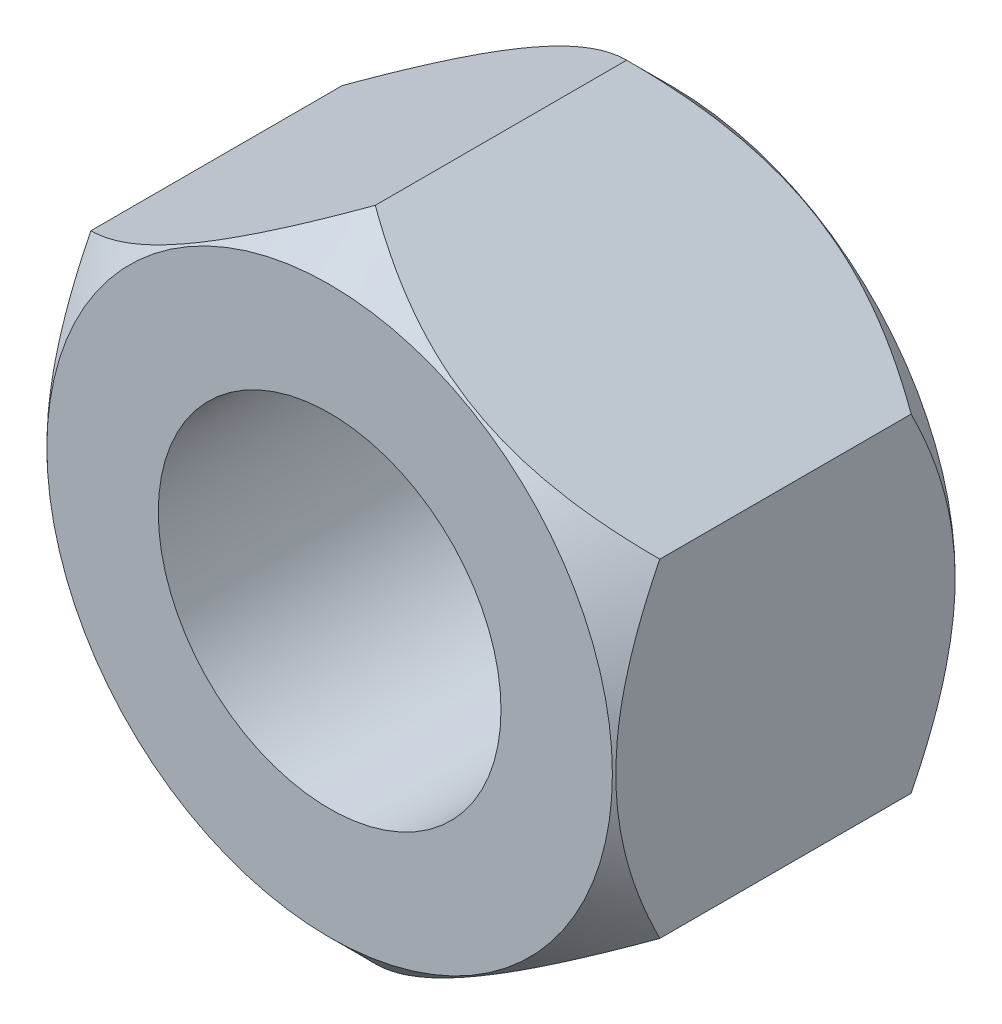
ISO-10303-21;
HEADER;
FILE_DESCRIPTION(('STEP AP214'),'2;1');
FILE_NAME('part.step','',(''),(''),'','','');
FILE_SCHEMA(('AUTOMOTIVE_DESIGN { 1 0 10303 214 1 1 1 1 }'));
ENDSEC;
DATA;
#1=APPLICATION_CONTEXT('core data for automotive mechanical design processes');
#2=APPLICATION_PROTOCOL_DEFINITION('international standard','automotive_design',2000,#1);
#3=PRODUCT_CONTEXT('',#1,'mechanical');
#4=PRODUCT('Part','Part','',(#3));
#5=PRODUCT_RELATED_PRODUCT_CATEGORY('part','',(#4));
#6=PRODUCT_DEFINITION_FORMATION('','',#4);
#7=PRODUCT_DEFINITION_CONTEXT('part definition',#1,'design');
#8=PRODUCT_DEFINITION('design','',#6,#7);
#9=PRODUCT_DEFINITION_SHAPE('','',#8);
#10=(LENGTH_UNIT() NAMED_UNIT(*) SI_UNIT(.MILLI.,.METRE.));
#11=(NAMED_UNIT(*) PLANE_ANGLE_UNIT() SI_UNIT($,.RADIAN.));
#12=(NAMED_UNIT(*) SI_UNIT($,.STERADIAN.) SOLID_ANGLE_UNIT());
#13=UNCERTAINTY_MEASURE_WITH_UNIT(LENGTH_MEASURE(1.E-05),#10,'distance_accuracy_value','');
#14=(GEOMETRIC_REPRESENTATION_CONTEXT(3) GLOBAL_UNCERTAINTY_ASSIGNED_CONTEXT((#13)) GLOBAL_UNIT_ASSIGNED_CONTEXT((#10,
#11,#12)) REPRESENTATION_CONTEXT('',''));
#15=CARTESIAN_POINT('',(0.,0.,0.));
#16=DIRECTION('',(0.,0.,1.));
#17=DIRECTION('',(1.,0.,0.));
#18=AXIS2_PLACEMENT_3D('',#15,#16,#17);
#19=CARTESIAN_POINT('',(0.,0.,6.));
#20=DIRECTION('',(0.,0.,-1.));
#21=DIRECTION('',(-1.,0.,0.));
#22=AXIS2_PLACEMENT_3D('',#19,#20,#21);
#23=CONICAL_SURFACE('',#22,4.95,0.785398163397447);
#24=CARTESIAN_POINT('',(0.,0.,6.));
#25=DIRECTION('',(0.,0.,1.));
#26=DIRECTION('',(1.,0.,0.));
#27=AXIS2_PLACEMENT_3D('',#24,#25,#26);
#28=CIRCLE('',#27,4.95);
#29=CARTESIAN_POINT('',(4.95,0.,6.));
#30=VERTEX_POINT('',#29);
#31=EDGE_CURVE('E235',#30,#30,#28,.T.);
#32=ORIENTED_EDGE('',*,*,#31,.F.);
#33=EDGE_LOOP('',(#32));
#34=FACE_BOUND('',#33,.T.);
#35=CARTESIAN_POINT('',(-0.000200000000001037,-5.75011547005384,5.19988452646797));
#36=CARTESIAN_POINT('',(0.0854228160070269,-5.70068111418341,5.24931443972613));
#37=CARTESIAN_POINT('',(0.171703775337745,-5.65086677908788,5.29722744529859));
#38=CARTESIAN_POINT('',(0.345711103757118,-5.55040360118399,5.38955819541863));
#39=CARTESIAN_POINT('',(0.433438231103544,-5.49975432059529,5.43397403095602));
#40=CARTESIAN_POINT('',(0.699797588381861,-5.34597167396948,5.56166239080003));
#41=CARTESIAN_POINT('',(0.880684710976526,-5.24153644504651,5.63883102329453));
#42=CARTESIAN_POINT('',(1.24545808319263,-5.03093444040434,5.77097708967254));
#43=CARTESIAN_POINT('',(1.42925109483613,-4.92482149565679,5.82628745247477));
#44=CARTESIAN_POINT('',(1.70796230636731,-4.7639075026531,5.89026802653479));
#45=CARTESIAN_POINT('',(1.80127638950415,-4.71003259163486,5.90842216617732));
#46=CARTESIAN_POINT('',(1.98869467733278,-4.60182659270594,5.93799130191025));
#47=CARTESIAN_POINT('',(2.08279876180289,-4.54749557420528,5.94940730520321));
#48=CARTESIAN_POINT('',(2.31211551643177,-4.41509948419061,5.96854775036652));
#49=CARTESIAN_POINT('',(2.44757526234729,-4.33689176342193,5.97256391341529));
#50=CARTESIAN_POINT('',(2.71825062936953,-4.18061726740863,5.96582390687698));
#51=CARTESIAN_POINT('',(2.85346614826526,-4.10255055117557,5.95506255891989));
#52=CARTESIAN_POINT('',(3.12262241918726,-3.94715310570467,5.9194018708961));
#53=CARTESIAN_POINT('',(3.25656157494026,-3.86982329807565,5.89448671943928));
#54=CARTESIAN_POINT('',(3.52213780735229,-3.7164927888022,5.83187297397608));
#55=CARTESIAN_POINT('',(3.65377505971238,-3.64049198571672,5.79417536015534));
#56=CARTESIAN_POINT('',(3.88745848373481,-3.50557479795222,5.71661848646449));
#57=CARTESIAN_POINT('',(3.99002202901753,-3.44635970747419,5.67879867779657));
#58=CARTESIAN_POINT('',(4.19330791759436,-3.32899254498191,5.59706431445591));
#59=CARTESIAN_POINT('',(4.29403020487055,-3.2708405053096,5.5531495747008));
#60=CARTESIAN_POINT('',(4.49331634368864,-3.15578259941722,5.46020981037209));
#61=CARTESIAN_POINT('',(4.59188586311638,-3.09887346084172,5.41120085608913));
#62=CARTESIAN_POINT('',(4.78719959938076,-2.98610902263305,5.308716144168));
#63=CARTESIAN_POINT('',(4.88394489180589,-2.93025310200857,5.25524312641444));
#64=CARTESIAN_POINT('',(4.97984607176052,-2.87488452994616,5.19988452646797));
#65=B_SPLINE_CURVE_WITH_KNOTS('',3,(#35,#36,#37,#38,#39,#40,#41,#42,#43,#44,#45,#46,#47,#48,#49,
#50,#51,#52,#53,#54,#55,#56,#57,#58,#59,#60,#61,#62,#63,#64),.UNSPECIFIED.,.F.,.F.,(4,2,2,2,2,2,
2,2,2,2,2,2,2,2,4),(0.,0.331590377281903,0.663360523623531,1.33048285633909,1.98701153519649,
2.31463197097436,2.64220342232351,3.11087506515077,3.57971098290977,4.04907167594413,
4.51839638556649,4.89118842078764,5.26399177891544,5.63565286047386,6.0070874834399),.UNSPECIFIED.);
#66=CARTESIAN_POINT('',(0.,-5.75,5.2));
#67=VERTEX_POINT('',#66);
#68=CARTESIAN_POINT('',(4.97964607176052,-2.875,5.2));
#69=VERTEX_POINT('',#68);
#70=EDGE_CURVE('E176',#67,#69,#65,.T.);
#71=ORIENTED_EDGE('',*,*,#70,.T.);
#72=CARTESIAN_POINT('',(4.97964607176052,-5.98792729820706,3.16205108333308));
#73=CARTESIAN_POINT('',(4.97964607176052,-5.84321555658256,3.27329073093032));
#74=CARTESIAN_POINT('',(4.97964607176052,-5.69772272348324,3.38353024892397));
#75=CARTESIAN_POINT('',(4.97964607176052,-5.40485610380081,3.60155250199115));
#76=CARTESIAN_POINT('',(4.97964607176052,-5.2574818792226,3.70933464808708));
#77=CARTESIAN_POINT('',(4.97964607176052,-4.95945660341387,3.92275269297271));
#78=CARTESIAN_POINT('',(4.97964607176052,-4.80878904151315,4.02836561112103));
#79=CARTESIAN_POINT('',(4.97964607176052,-4.50494403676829,4.23590471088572));
#80=CARTESIAN_POINT('',(4.97964607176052,-4.35176676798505,4.33783114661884));
#81=CARTESIAN_POINT('',(4.97964607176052,-4.03271914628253,4.54344974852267));
#82=CARTESIAN_POINT('',(4.97964607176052,-3.86665791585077,4.64684722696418));
#83=CARTESIAN_POINT('',(4.97964607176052,-3.53063655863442,4.84720800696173));
#84=CARTESIAN_POINT('',(4.97964607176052,-3.3606757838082,4.94417022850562));
#85=CARTESIAN_POINT('',(4.97964607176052,-3.01681159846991,5.12959431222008));
#86=CARTESIAN_POINT('',(4.97964607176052,-2.84292175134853,5.21808113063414));
#87=CARTESIAN_POINT('',(4.97964607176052,-2.49023378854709,5.38457192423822));
#88=CARTESIAN_POINT('',(4.97964607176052,-2.31143803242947,5.4625808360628));
#89=CARTESIAN_POINT('',(4.97964607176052,-1.96631864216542,5.59830337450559));
#90=CARTESIAN_POINT('',(4.97964607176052,-1.80048733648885,5.65725617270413));
#91=CARTESIAN_POINT('',(4.97964607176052,-1.46461005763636,5.76188694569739));
#92=CARTESIAN_POINT('',(4.97964607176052,-1.29456381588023,5.80756407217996));
#93=CARTESIAN_POINT('',(4.97964607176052,-0.954227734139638,5.88241379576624));
#94=CARTESIAN_POINT('',(4.97964607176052,-0.784004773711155,5.91188538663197));
#95=CARTESIAN_POINT('',(4.97964607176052,-0.441457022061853,5.95371096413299));
#96=CARTESIAN_POINT('',(4.97964607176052,-0.269132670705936,5.96606847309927));
#97=CARTESIAN_POINT('',(4.97964607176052,0.0683878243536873,5.97261918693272));
#98=CARTESIAN_POINT('',(4.97964607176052,0.233569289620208,5.96757626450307));
#99=CARTESIAN_POINT('',(4.97964607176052,0.562637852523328,5.94135543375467));
#100=CARTESIAN_POINT('',(4.97964607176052,0.726524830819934,5.92017605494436));
#101=CARTESIAN_POINT('',(4.97964607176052,1.05459540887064,5.86251798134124));
#102=CARTESIAN_POINT('',(4.97964607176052,1.21873080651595,5.82576961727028));
#103=CARTESIAN_POINT('',(4.97964607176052,1.5433889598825,5.73900877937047));
#104=CARTESIAN_POINT('',(4.97964607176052,1.70391192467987,5.68899707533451));
#105=CARTESIAN_POINT('',(4.97964607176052,2.03042353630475,5.57461810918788));
#106=CARTESIAN_POINT('',(4.97964607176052,2.19617318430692,5.50957627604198));
#107=CARTESIAN_POINT('',(4.97964607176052,2.52340758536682,5.36944633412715));
#108=CARTESIAN_POINT('',(4.97964607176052,2.68489037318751,5.29435368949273));
#109=CARTESIAN_POINT('',(4.97964607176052,3.00435467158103,5.13590311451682));
#110=CARTESIAN_POINT('',(4.97964607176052,3.1623234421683,5.05251970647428));
#111=CARTESIAN_POINT('',(4.97964607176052,3.47464063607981,4.87932286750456));
#112=CARTESIAN_POINT('',(4.97964607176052,3.62898961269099,4.78951042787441));
#113=CARTESIAN_POINT('',(4.97964607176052,3.92699519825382,4.60927484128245));
#114=CARTESIAN_POINT('',(4.97964607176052,4.0708033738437,4.51910097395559));
#115=CARTESIAN_POINT('',(4.97964607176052,4.3559490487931,4.33491664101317));
#116=CARTESIAN_POINT('',(4.97964607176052,4.49728636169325,4.24090588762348));
#117=CARTESIAN_POINT('',(4.97964607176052,4.77667683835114,4.05049781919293));
#118=CARTESIAN_POINT('',(4.97964607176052,4.9147472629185,3.9541257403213));
#119=CARTESIAN_POINT('',(4.97964607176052,5.1889942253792,3.75879943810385));
#120=CARTESIAN_POINT('',(4.97964607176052,5.3251712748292,3.65984593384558));
#121=CARTESIAN_POINT('',(4.97964607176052,5.46055413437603,3.55983583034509));
#122=B_SPLINE_CURVE_WITH_KNOTS('',3,(#72,#73,#74,#75,#76,#77,#78,#79,#80,#81,#82,#83,#84,#85,
#86,#87,#88,#89,#90,#91,#92,#93,#94,#95,#96,#97,#98,#99,#100,#101,#102,#103,#104,#105,#106,#107,
#108,#109,#110,#111,#112,#113,#114,#115,#116,#117,#118,#119,#120,#121),.UNSPECIFIED.,.F.,.F.,(4,
2,2,2,2,2,2,2,2,2,2,2,2,2,2,2,2,2,2,2,2,2,2,2,4),(0.,0.547588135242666,1.09530616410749,
1.64725084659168,2.19915740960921,2.78590290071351,3.37274661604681,3.95780549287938,
4.542587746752,5.07012767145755,5.59770129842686,6.11518322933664,6.63255863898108,
7.12751573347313,7.6225179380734,8.12646913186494,8.63039108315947,9.16414491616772,
9.69814044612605,10.2338308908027,10.7694389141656,11.2785915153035,11.7877823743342,
12.2928831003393,12.7978445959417),.UNSPECIFIED.);
#123=CARTESIAN_POINT('',(4.97964607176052,2.875,5.2));
#124=VERTEX_POINT('',#123);
#125=EDGE_CURVE('E183',#69,#124,#122,.T.);
#126=ORIENTED_EDGE('',*,*,#125,.T.);
#127=CARTESIAN_POINT('',(4.97984607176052,2.87488452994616,5.19988452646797));
#128=CARTESIAN_POINT('',(4.89422325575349,2.92431888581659,5.24931443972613));
#129=CARTESIAN_POINT('',(4.80794229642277,2.97413322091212,5.29722744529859));
#130=CARTESIAN_POINT('',(4.6339349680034,3.07459639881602,5.38955819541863));
#131=CARTESIAN_POINT('',(4.54620784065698,3.12524567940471,5.43397403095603));
#132=CARTESIAN_POINT('',(4.27984848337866,3.27902832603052,5.56166239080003));
#133=CARTESIAN_POINT('',(4.09896136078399,3.38346355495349,5.63883102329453));
#134=CARTESIAN_POINT('',(3.73418798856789,3.59406555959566,5.77097708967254));
#135=CARTESIAN_POINT('',(3.55039497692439,3.70017850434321,5.82628745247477));
#136=CARTESIAN_POINT('',(3.2716837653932,3.8610924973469,5.89026802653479));
#137=CARTESIAN_POINT('',(3.17836968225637,3.91496740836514,5.90842216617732));
#138=CARTESIAN_POINT('',(2.99095139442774,4.02317340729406,5.93799130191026));
#139=CARTESIAN_POINT('',(2.89684730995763,4.07750442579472,5.94940730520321));
#140=CARTESIAN_POINT('',(2.66753055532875,4.20990051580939,5.96854775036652));
#141=CARTESIAN_POINT('',(2.53207080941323,4.28810823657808,5.97256391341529));
#142=CARTESIAN_POINT('',(2.26139544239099,4.44438273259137,5.96582390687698));
#143=CARTESIAN_POINT('',(2.12617992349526,4.52244944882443,5.95506255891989));
#144=CARTESIAN_POINT('',(1.85702365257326,4.67784689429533,5.91940187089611));
#145=CARTESIAN_POINT('',(1.72308449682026,4.75517670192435,5.89448671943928));
#146=CARTESIAN_POINT('',(1.45750826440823,4.9085072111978,5.83187297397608));
#147=CARTESIAN_POINT('',(1.32587101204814,4.98450801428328,5.79417536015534));
#148=CARTESIAN_POINT('',(1.09218758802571,5.11942520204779,5.71661848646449));
#149=CARTESIAN_POINT('',(0.989624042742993,5.17864029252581,5.67879867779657));
#150=CARTESIAN_POINT('',(0.786338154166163,5.29600745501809,5.59706431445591));
#151=CARTESIAN_POINT('',(0.685615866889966,5.3541594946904,5.5531495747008));
#152=CARTESIAN_POINT('',(0.486329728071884,5.46921740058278,5.46020981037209));
#153=CARTESIAN_POINT('',(0.387760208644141,5.52612653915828,5.41120085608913));
#154=CARTESIAN_POINT('',(0.192446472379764,5.63889097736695,5.308716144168));
#155=CARTESIAN_POINT('',(0.0957011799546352,5.69474689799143,5.25524312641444));
#156=CARTESIAN_POINT('',(-0.000200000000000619,5.75011547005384,5.19988452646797));
#157=B_SPLINE_CURVE_WITH_KNOTS('',3,(#127,#128,#129,#130,#131,#132,#133,#134,#135,#136,#137,
#138,#139,#140,#141,#142,#143,#144,#145,#146,#147,#148,#149,#150,#151,#152,#153,#154,#155,#156),
.UNSPECIFIED.,.F.,.F.,(4,2,2,2,2,2,2,2,2,2,2,2,2,2,4),(0.,0.331590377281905,0.663360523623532,
1.33048285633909,1.98701153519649,2.31463197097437,2.64220342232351,3.11087506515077,
3.57971098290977,4.04907167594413,4.51839638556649,4.89118842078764,5.26399177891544,
5.63565286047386,6.0070874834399),.UNSPECIFIED.);
#158=CARTESIAN_POINT('',(0.,5.75,5.2));
#159=VERTEX_POINT('',#158);
#160=EDGE_CURVE('E147',#124,#159,#157,.T.);
#161=ORIENTED_EDGE('',*,*,#160,.T.);
#162=CARTESIAN_POINT('',(0.000199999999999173,5.75011547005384,5.19988452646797));
#163=CARTESIAN_POINT('',(-0.0854228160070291,5.70068111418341,5.24931443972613));
#164=CARTESIAN_POINT('',(-0.171703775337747,5.65086677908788,5.29722744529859));
#165=CARTESIAN_POINT('',(-0.34571110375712,5.55040360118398,5.38955819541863));
#166=CARTESIAN_POINT('',(-0.433438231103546,5.49975432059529,5.43397403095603));
#167=CARTESIAN_POINT('',(-0.699797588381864,5.34597167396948,5.56166239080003));
#168=CARTESIAN_POINT('',(-0.880684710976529,5.24153644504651,5.63883102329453));
#169=CARTESIAN_POINT('',(-1.24545808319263,5.03093444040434,5.77097708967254));
#170=CARTESIAN_POINT('',(-1.42925109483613,4.92482149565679,5.82628745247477));
#171=CARTESIAN_POINT('',(-1.70796230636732,4.76390750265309,5.89026802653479));
#172=CARTESIAN_POINT('',(-1.80127638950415,4.71003259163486,5.90842216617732));
#173=CARTESIAN_POINT('',(-1.98869467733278,4.60182659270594,5.93799130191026));
#174=CARTESIAN_POINT('',(-2.08279876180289,4.54749557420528,5.94940730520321));
#175=CARTESIAN_POINT('',(-2.31211551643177,4.41509948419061,5.96854775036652));
#176=CARTESIAN_POINT('',(-2.44757526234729,4.33689176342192,5.97256391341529));
#177=CARTESIAN_POINT('',(-2.71825062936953,4.18061726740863,5.96582390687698));
#178=CARTESIAN_POINT('',(-2.85346614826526,4.10255055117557,5.95506255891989));
#179=CARTESIAN_POINT('',(-3.12262241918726,3.94715310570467,5.9194018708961));
#180=CARTESIAN_POINT('',(-3.25656157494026,3.86982329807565,5.89448671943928));
#181=CARTESIAN_POINT('',(-3.52213780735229,3.7164927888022,5.83187297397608));
#182=CARTESIAN_POINT('',(-3.65377505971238,3.64049198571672,5.79417536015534));
#183=CARTESIAN_POINT('',(-3.88745848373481,3.50557479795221,5.71661848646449));
#184=CARTESIAN_POINT('',(-3.99002202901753,3.44635970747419,5.67879867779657));
#185=CARTESIAN_POINT('',(-4.19330791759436,3.32899254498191,5.59706431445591));
#186=CARTESIAN_POINT('',(-4.29403020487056,3.2708405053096,5.5531495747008));
#187=CARTESIAN_POINT('',(-4.49331634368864,3.15578259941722,5.46020981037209));
#188=CARTESIAN_POINT('',(-4.59188586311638,3.09887346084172,5.41120085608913));
#189=CARTESIAN_POINT('',(-4.78719959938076,2.98610902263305,5.308716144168));
#190=CARTESIAN_POINT('',(-4.88394489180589,2.93025310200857,5.25524312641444));
#191=CARTESIAN_POINT('',(-4.97984607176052,2.87488452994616,5.19988452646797));
#192=B_SPLINE_CURVE_WITH_KNOTS('',3,(#162,#163,#164,#165,#166,#167,#168,#169,#170,#171,#172,
#173,#174,#175,#176,#177,#178,#179,#180,#181,#182,#183,#184,#185,#186,#187,#188,#189,#190,#191),
.UNSPECIFIED.,.F.,.F.,(4,2,2,2,2,2,2,2,2,2,2,2,2,2,4),(0.,0.331590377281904,0.663360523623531,
1.33048285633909,1.98701153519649,2.31463197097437,2.64220342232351,3.11087506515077,
3.57971098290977,4.04907167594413,4.51839638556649,4.89118842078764,5.26399177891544,
5.63565286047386,6.0070874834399),.UNSPECIFIED.);
#193=CARTESIAN_POINT('',(-4.97964607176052,2.875,5.2));
#194=VERTEX_POINT('',#193);
#195=EDGE_CURVE('E105',#159,#194,#192,.T.);
#196=ORIENTED_EDGE('',*,*,#195,.T.);
#197=CARTESIAN_POINT('',(-4.97964607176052,-5.98792729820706,3.16205108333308));
#198=CARTESIAN_POINT('',(-4.97964607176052,-5.84321555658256,3.27329073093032));
#199=CARTESIAN_POINT('',(-4.97964607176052,-5.69772272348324,3.38353024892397));
#200=CARTESIAN_POINT('',(-4.97964607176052,-5.40485610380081,3.60155250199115));
#201=CARTESIAN_POINT('',(-4.97964607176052,-5.2574818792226,3.70933464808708));
#202=CARTESIAN_POINT('',(-4.97964607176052,-4.95945660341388,3.92275269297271));
#203=CARTESIAN_POINT('',(-4.97964607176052,-4.80878904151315,4.02836561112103));
#204=CARTESIAN_POINT('',(-4.97964607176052,-4.50494403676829,4.23590471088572));
#205=CARTESIAN_POINT('',(-4.97964607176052,-4.35176676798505,4.33783114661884));
#206=CARTESIAN_POINT('',(-4.97964607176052,-4.03271914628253,4.54344974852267));
#207=CARTESIAN_POINT('',(-4.97964607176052,-3.86665791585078,4.64684722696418));
#208=CARTESIAN_POINT('',(-4.97964607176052,-3.53063655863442,4.84720800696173));
#209=CARTESIAN_POINT('',(-4.97964607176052,-3.3606757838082,4.94417022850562));
#210=CARTESIAN_POINT('',(-4.97964607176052,-3.01681159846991,5.12959431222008));
#211=CARTESIAN_POINT('',(-4.97964607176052,-2.84292175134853,5.21808113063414));
#212=CARTESIAN_POINT('',(-4.97964607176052,-2.49023378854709,5.38457192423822));
#213=CARTESIAN_POINT('',(-4.97964607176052,-2.31143803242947,5.4625808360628));
#214=CARTESIAN_POINT('',(-4.97964607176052,-1.96631864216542,5.59830337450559));
#215=CARTESIAN_POINT('',(-4.97964607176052,-1.80048733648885,5.65725617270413));
#216=CARTESIAN_POINT('',(-4.97964607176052,-1.46461005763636,5.76188694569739));
#217=CARTESIAN_POINT('',(-4.97964607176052,-1.29456381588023,5.80756407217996));
#218=CARTESIAN_POINT('',(-4.97964607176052,-0.954227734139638,5.88241379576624));
#219=CARTESIAN_POINT('',(-4.97964607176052,-0.784004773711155,5.91188538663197));
#220=CARTESIAN_POINT('',(-4.97964607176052,-0.441457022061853,5.95371096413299));
#221=CARTESIAN_POINT('',(-4.97964607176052,-0.269132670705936,5.96606847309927));
#222=CARTESIAN_POINT('',(-4.97964607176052,0.0683878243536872,5.97261918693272));
#223=CARTESIAN_POINT('',(-4.97964607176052,0.233569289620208,5.96757626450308));
#224=CARTESIAN_POINT('',(-4.97964607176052,0.562637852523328,5.94135543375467));
#225=CARTESIAN_POINT('',(-4.97964607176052,0.726524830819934,5.92017605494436));
#226=CARTESIAN_POINT('',(-4.97964607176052,1.05459540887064,5.86251798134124));
#227=CARTESIAN_POINT('',(-4.97964607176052,1.21873080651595,5.82576961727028));
#228=CARTESIAN_POINT('',(-4.97964607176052,1.5433889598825,5.73900877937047));
#229=CARTESIAN_POINT('',(-4.97964607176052,1.70391192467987,5.68899707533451));
#230=CARTESIAN_POINT('',(-4.97964607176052,2.03042353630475,5.57461810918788));
#231=CARTESIAN_POINT('',(-4.97964607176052,2.19617318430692,5.50957627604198));
#232=CARTESIAN_POINT('',(-4.97964607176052,2.52340758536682,5.36944633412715));
#233=CARTESIAN_POINT('',(-4.97964607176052,2.68489037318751,5.29435368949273));
#234=CARTESIAN_POINT('',(-4.97964607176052,3.00435467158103,5.13590311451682));
#235=CARTESIAN_POINT('',(-4.97964607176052,3.1623234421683,5.05251970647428));
#236=CARTESIAN_POINT('',(-4.97964607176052,3.47464063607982,4.87932286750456));
#237=CARTESIAN_POINT('',(-4.97964607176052,3.62898961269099,4.78951042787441));
#238=CARTESIAN_POINT('',(-4.97964607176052,3.92699519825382,4.60927484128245));
#239=CARTESIAN_POINT('',(-4.97964607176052,4.07080337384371,4.51910097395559));
#240=CARTESIAN_POINT('',(-4.97964607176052,4.35594904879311,4.33491664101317));
#241=CARTESIAN_POINT('',(-4.97964607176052,4.49728636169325,4.24090588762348));
#242=CARTESIAN_POINT('',(-4.97964607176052,4.77667683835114,4.05049781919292));
#243=CARTESIAN_POINT('',(-4.97964607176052,4.9147472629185,3.9541257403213));
#244=CARTESIAN_POINT('',(-4.97964607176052,5.18899422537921,3.75879943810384));
#245=CARTESIAN_POINT('',(-4.97964607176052,5.3251712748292,3.65984593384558));
#246=CARTESIAN_POINT('',(-4.97964607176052,5.46055413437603,3.55983583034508));
#247=B_SPLINE_CURVE_WITH_KNOTS('',3,(#197,#198,#199,#200,#201,#202,#203,#204,#205,#206,#207,
#208,#209,#210,#211,#212,#213,#214,#215,#216,#217,#218,#219,#220,#221,#222,#223,#224,#225,#226,
#227,#228,#229,#230,#231,#232,#233,#234,#235,#236,#237,#238,#239,#240,#241,#242,#243,#244,#245,
#246),.UNSPECIFIED.,.F.,.F.,(4,2,2,2,2,2,2,2,2,2,2,2,2,2,2,2,2,2,2,2,2,2,2,2,4),(0.,
0.547588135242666,1.09530616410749,1.64725084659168,2.19915740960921,2.78590290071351,
3.37274661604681,3.95780549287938,4.542587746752,5.07012767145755,5.59770129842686,
6.11518322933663,6.63255863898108,7.12751573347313,7.6225179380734,8.12646913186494,
8.63039108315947,9.16414491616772,9.69814044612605,10.2338308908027,10.7694389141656,
11.2785915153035,11.7877823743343,12.2928831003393,12.7978445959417),.UNSPECIFIED.);
#248=CARTESIAN_POINT('',(-4.97964607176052,-2.875,5.2));
#249=VERTEX_POINT('',#248);
#250=EDGE_CURVE('E146',#194,#249,#247,.F.);
#251=ORIENTED_EDGE('',*,*,#250,.T.);
#252=CARTESIAN_POINT('',(-4.97984607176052,-2.87488452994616,5.19988452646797));
#253=CARTESIAN_POINT('',(-4.89422325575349,-2.9243188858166,5.24931443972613));
#254=CARTESIAN_POINT('',(-4.80794229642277,-2.97413322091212,5.29722744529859));
#255=CARTESIAN_POINT('',(-4.6339349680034,-3.07459639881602,5.38955819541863));
#256=CARTESIAN_POINT('',(-4.54620784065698,-3.12524567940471,5.43397403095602));
#257=CARTESIAN_POINT('',(-4.27984848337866,-3.27902832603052,5.56166239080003));
#258=CARTESIAN_POINT('',(-4.09896136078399,-3.38346355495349,5.63883102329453));
#259=CARTESIAN_POINT('',(-3.73418798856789,-3.59406555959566,5.77097708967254));
#260=CARTESIAN_POINT('',(-3.55039497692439,-3.70017850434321,5.82628745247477));
#261=CARTESIAN_POINT('',(-3.2716837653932,-3.86109249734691,5.89026802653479));
#262=CARTESIAN_POINT('',(-3.17836968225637,-3.91496740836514,5.90842216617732));
#263=CARTESIAN_POINT('',(-2.99095139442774,-4.02317340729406,5.93799130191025));
#264=CARTESIAN_POINT('',(-2.89684730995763,-4.07750442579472,5.94940730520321));
#265=CARTESIAN_POINT('',(-2.66753055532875,-4.2099005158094,5.96854775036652));
#266=CARTESIAN_POINT('',(-2.53207080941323,-4.28810823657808,5.97256391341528));
#267=CARTESIAN_POINT('',(-2.26139544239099,-4.44438273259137,5.96582390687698));
#268=CARTESIAN_POINT('',(-2.12617992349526,-4.52244944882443,5.95506255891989));
#269=CARTESIAN_POINT('',(-1.85702365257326,-4.67784689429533,5.9194018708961));
#270=CARTESIAN_POINT('',(-1.72308449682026,-4.75517670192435,5.89448671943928));
#271=CARTESIAN_POINT('',(-1.45750826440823,-4.9085072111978,5.83187297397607));
#272=CARTESIAN_POINT('',(-1.32587101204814,-4.98450801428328,5.79417536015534));
#273=CARTESIAN_POINT('',(-1.09218758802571,-5.11942520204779,5.71661848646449));
#274=CARTESIAN_POINT('',(-0.989624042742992,-5.17864029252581,5.67879867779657));
#275=CARTESIAN_POINT('',(-0.786338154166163,-5.29600745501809,5.59706431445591));
#276=CARTESIAN_POINT('',(-0.685615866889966,-5.3541594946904,5.5531495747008));
#277=CARTESIAN_POINT('',(-0.486329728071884,-5.46921740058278,5.46020981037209));
#278=CARTESIAN_POINT('',(-0.387760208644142,-5.52612653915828,5.41120085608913));
#279=CARTESIAN_POINT('',(-0.192446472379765,-5.63889097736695,5.308716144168));
#280=CARTESIAN_POINT('',(-0.0957011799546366,-5.69474689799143,5.25524312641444));
#281=CARTESIAN_POINT('',(0.000199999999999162,-5.75011547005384,5.19988452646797));
#282=B_SPLINE_CURVE_WITH_KNOTS('',3,(#252,#253,#254,#255,#256,#257,#258,#259,#260,#261,#262,
#263,#264,#265,#266,#267,#268,#269,#270,#271,#272,#273,#274,#275,#276,#277,#278,#279,#280,#281),
.UNSPECIFIED.,.F.,.F.,(4,2,2,2,2,2,2,2,2,2,2,2,2,2,4),(0.,0.331590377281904,0.663360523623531,
1.33048285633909,1.98701153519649,2.31463197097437,2.64220342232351,3.11087506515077,
3.57971098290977,4.04907167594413,4.5183963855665,4.89118842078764,5.26399177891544,
5.63565286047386,6.0070874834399),.UNSPECIFIED.);
#283=EDGE_CURVE('E170',#249,#67,#282,.T.);
#284=ORIENTED_EDGE('',*,*,#283,.T.);
#285=EDGE_LOOP('',(#71,#126,#161,#196,#251,#284));
#286=FACE_BOUND('',#285,.T.);
#287=ADVANCED_FACE('F37',(#34,#286),#23,.T.);
#288=CARTESIAN_POINT('',(0.,0.,0.8));
#289=DIRECTION('',(0.,0.,1.));
#290=DIRECTION('',(1.,0.,0.));
#291=AXIS2_PLACEMENT_3D('',#288,#289,#290);
#292=CONICAL_SURFACE('',#291,5.75,0.78539816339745);
#293=CARTESIAN_POINT('',(0.,0.,0.));
#294=DIRECTION('',(0.,0.,1.));
#295=DIRECTION('',(1.,0.,0.));
#296=AXIS2_PLACEMENT_3D('',#293,#294,#295);
#297=CIRCLE('',#296,4.95);
#298=CARTESIAN_POINT('',(4.95,0.,0.));
#299=VERTEX_POINT('',#298);
#300=EDGE_CURVE('E98',#299,#299,#297,.F.);
#301=ORIENTED_EDGE('',*,*,#300,.F.);
#302=EDGE_LOOP('',(#301));
#303=FACE_BOUND('',#302,.T.);
#304=CARTESIAN_POINT('',(-0.000200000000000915,5.75011547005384,0.800115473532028));
#305=CARTESIAN_POINT('',(0.0854228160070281,5.70068111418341,0.750685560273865));
#306=CARTESIAN_POINT('',(0.171703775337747,5.65086677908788,0.702772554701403));
#307=CARTESIAN_POINT('',(0.345711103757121,5.55040360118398,0.610441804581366));
#308=CARTESIAN_POINT('',(0.433438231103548,5.49975432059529,0.566025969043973));
#309=CARTESIAN_POINT('',(0.699797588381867,5.34597167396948,0.438337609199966));
#310=CARTESIAN_POINT('',(0.880684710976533,5.24153644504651,0.36116897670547));
#311=CARTESIAN_POINT('',(1.24545808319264,5.03093444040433,0.229022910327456));
#312=CARTESIAN_POINT('',(1.42925109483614,4.92482149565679,0.173712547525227));
#313=CARTESIAN_POINT('',(1.70796230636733,4.76390750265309,0.109731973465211));
#314=CARTESIAN_POINT('',(1.80127638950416,4.71003259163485,0.091577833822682));
#315=CARTESIAN_POINT('',(1.98869467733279,4.60182659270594,0.0620086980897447));
#316=CARTESIAN_POINT('',(2.0827987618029,4.54749557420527,0.05059269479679));
#317=CARTESIAN_POINT('',(2.31211551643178,4.4150994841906,0.031452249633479));
#318=CARTESIAN_POINT('',(2.4475752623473,4.33689176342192,0.0274360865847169));
#319=CARTESIAN_POINT('',(2.71825062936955,4.18061726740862,0.0341760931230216));
#320=CARTESIAN_POINT('',(2.85346614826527,4.10255055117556,0.0449374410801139));
#321=CARTESIAN_POINT('',(3.12262241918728,3.94715310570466,0.0805981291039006));
#322=CARTESIAN_POINT('',(3.25656157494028,3.86982329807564,0.105513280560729));
#323=CARTESIAN_POINT('',(3.52213780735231,3.71649278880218,0.168127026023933));
#324=CARTESIAN_POINT('',(3.6537750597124,3.6404919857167,0.205824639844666));
#325=CARTESIAN_POINT('',(3.88745848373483,3.5055747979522,0.283381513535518));
#326=CARTESIAN_POINT('',(3.99002202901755,3.44635970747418,0.321201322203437));
#327=CARTESIAN_POINT('',(4.19330791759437,3.3289925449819,0.402935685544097));
#328=CARTESIAN_POINT('',(4.29403020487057,3.27084050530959,0.446850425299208));
#329=CARTESIAN_POINT('',(4.49331634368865,3.15578259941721,0.539790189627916));
#330=CARTESIAN_POINT('',(4.59188586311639,3.09887346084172,0.588799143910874));
#331=CARTESIAN_POINT('',(4.78719959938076,2.98610902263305,0.691283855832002));
#332=CARTESIAN_POINT('',(4.88394489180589,2.93025310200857,0.744756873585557));
#333=CARTESIAN_POINT('',(4.97984607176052,2.87488452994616,0.800115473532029));
#334=B_SPLINE_CURVE_WITH_KNOTS('',3,(#304,#305,#306,#307,#308,#309,#310,#311,#312,#313,#314,
#315,#316,#317,#318,#319,#320,#321,#322,#323,#324,#325,#326,#327,#328,#329,#330,#331,#332,#333),
.UNSPECIFIED.,.F.,.F.,(4,2,2,2,2,2,2,2,2,2,2,2,2,2,4),(0.,0.331590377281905,0.663360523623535,
1.3304828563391,1.9870115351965,2.31463197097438,2.64220342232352,3.11087506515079,
3.57971098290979,4.04907167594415,4.51839638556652,4.89118842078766,5.26399177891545,
5.63565286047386,6.0070874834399),.UNSPECIFIED.);
#335=CARTESIAN_POINT('',(0.,5.75,0.8));
#336=VERTEX_POINT('',#335);
#337=CARTESIAN_POINT('',(4.97964607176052,2.875,0.8));
#338=VERTEX_POINT('',#337);
#339=EDGE_CURVE('E93',#336,#338,#334,.T.);
#340=ORIENTED_EDGE('',*,*,#339,.T.);
#341=CARTESIAN_POINT('',(4.97964607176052,-5.98792729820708,2.83794891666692));
#342=CARTESIAN_POINT('',(4.97964607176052,-5.84321555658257,2.72670926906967));
#343=CARTESIAN_POINT('',(4.97964607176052,-5.69772272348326,2.61646975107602));
#344=CARTESIAN_POINT('',(4.97964607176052,-5.40485610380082,2.39844749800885));
#345=CARTESIAN_POINT('',(4.97964607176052,-5.25748187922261,2.29066535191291));
#346=CARTESIAN_POINT('',(4.97964607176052,-4.95945660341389,2.07724730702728));
#347=CARTESIAN_POINT('',(4.97964607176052,-4.80878904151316,1.97163438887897));
#348=CARTESIAN_POINT('',(4.97964607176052,-4.5049440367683,1.76409528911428));
#349=CARTESIAN_POINT('',(4.97964607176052,-4.35176676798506,1.66216885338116));
#350=CARTESIAN_POINT('',(4.97964607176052,-4.03271914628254,1.45655025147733));
#351=CARTESIAN_POINT('',(4.97964607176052,-3.86665791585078,1.35315277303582));
#352=CARTESIAN_POINT('',(4.97964607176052,-3.53063655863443,1.15279199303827));
#353=CARTESIAN_POINT('',(4.97964607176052,-3.3606757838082,1.05582977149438));
#354=CARTESIAN_POINT('',(4.97964607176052,-3.01681159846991,0.870405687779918));
#355=CARTESIAN_POINT('',(4.97964607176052,-2.84292175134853,0.781918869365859));
#356=CARTESIAN_POINT('',(4.97964607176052,-2.49023378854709,0.615428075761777));
#357=CARTESIAN_POINT('',(4.97964607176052,-2.31143803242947,0.537419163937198));
#358=CARTESIAN_POINT('',(4.97964607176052,-1.96631864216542,0.401696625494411));
#359=CARTESIAN_POINT('',(4.97964607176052,-1.80048733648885,0.342743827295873));
#360=CARTESIAN_POINT('',(4.97964607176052,-1.46461005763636,0.238113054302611));
#361=CARTESIAN_POINT('',(4.97964607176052,-1.29456381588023,0.192435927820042));
#362=CARTESIAN_POINT('',(4.97964607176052,-0.954227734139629,0.117586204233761));
#363=CARTESIAN_POINT('',(4.97964607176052,-0.784004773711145,0.0881146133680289));
#364=CARTESIAN_POINT('',(4.97964607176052,-0.441457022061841,0.0462890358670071));
#365=CARTESIAN_POINT('',(4.97964607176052,-0.269132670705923,0.0339315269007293));
#366=CARTESIAN_POINT('',(4.97964607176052,0.0683878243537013,0.027380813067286));
#367=CARTESIAN_POINT('',(4.97964607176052,0.233569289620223,0.0324237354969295));
#368=CARTESIAN_POINT('',(4.97964607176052,0.562637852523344,0.0586445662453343));
#369=CARTESIAN_POINT('',(4.97964607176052,0.726524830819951,0.0798239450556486));
#370=CARTESIAN_POINT('',(4.97964607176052,1.05459540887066,0.137482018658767));
#371=CARTESIAN_POINT('',(4.97964607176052,1.21873080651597,0.174230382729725));
#372=CARTESIAN_POINT('',(4.97964607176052,1.54338895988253,0.260991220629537));
#373=CARTESIAN_POINT('',(4.97964607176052,1.70391192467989,0.311002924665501));
#374=CARTESIAN_POINT('',(4.97964607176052,2.03042353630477,0.425381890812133));
#375=CARTESIAN_POINT('',(4.97964607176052,2.19617318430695,0.490423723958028));
#376=CARTESIAN_POINT('',(4.97964607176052,2.52340758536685,0.630553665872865));
#377=CARTESIAN_POINT('',(4.97964607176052,2.68489037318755,0.705646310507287));
#378=CARTESIAN_POINT('',(4.97964607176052,3.00435467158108,0.864096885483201));
#379=CARTESIAN_POINT('',(4.97964607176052,3.16232344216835,0.947480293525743));
#380=CARTESIAN_POINT('',(4.97964607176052,3.47464063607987,1.12067713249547));
#381=CARTESIAN_POINT('',(4.97964607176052,3.62898961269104,1.21048957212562));
#382=CARTESIAN_POINT('',(4.97964607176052,3.92699519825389,1.39072515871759));
#383=CARTESIAN_POINT('',(4.97964607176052,4.07080337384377,1.48089902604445));
#384=CARTESIAN_POINT('',(4.97964607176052,4.35594904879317,1.66508335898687));
#385=CARTESIAN_POINT('',(4.97964607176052,4.49728636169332,1.75909411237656));
#386=CARTESIAN_POINT('',(4.97964607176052,4.77667683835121,1.94950218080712));
#387=CARTESIAN_POINT('',(4.97964607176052,4.91474726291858,2.04587425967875));
#388=CARTESIAN_POINT('',(4.97964607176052,5.18899422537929,2.2412005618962));
#389=CARTESIAN_POINT('',(4.97964607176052,5.32517127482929,2.34015406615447));
#390=CARTESIAN_POINT('',(4.97964607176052,5.46055413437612,2.44016416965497));
#391=B_SPLINE_CURVE_WITH_KNOTS('',3,(#341,#342,#343,#344,#345,#346,#347,#348,#349,#350,#351,
#352,#353,#354,#355,#356,#357,#358,#359,#360,#361,#362,#363,#364,#365,#366,#367,#368,#369,#370,
#371,#372,#373,#374,#375,#376,#377,#378,#379,#380,#381,#382,#383,#384,#385,#386,#387,#388,#389,
#390),.UNSPECIFIED.,.F.,.F.,(4,2,2,2,2,2,2,2,2,2,2,2,2,2,2,2,2,2,2,2,2,2,2,2,4),(0.,
0.547588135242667,1.0953061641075,1.64725084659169,2.19915740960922,2.78590290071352,
3.37274661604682,3.95780549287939,4.54258774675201,5.07012767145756,5.59770129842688,
6.11518322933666,6.6325586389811,7.12751573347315,7.62251793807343,8.12646913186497,
8.6303910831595,9.16414491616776,9.69814044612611,10.2338308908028,10.7694389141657,
11.2785915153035,11.7877823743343,12.2928831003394,12.7978445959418),.UNSPECIFIED.);
#392=CARTESIAN_POINT('',(4.97964607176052,-2.875,0.800000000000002));
#393=VERTEX_POINT('',#392);
#394=EDGE_CURVE('E11',#338,#393,#391,.F.);
#395=ORIENTED_EDGE('',*,*,#394,.T.);
#396=CARTESIAN_POINT('',(4.97984607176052,-2.87488452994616,0.80011547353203));
#397=CARTESIAN_POINT('',(4.89422325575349,-2.92431888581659,0.750685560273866));
#398=CARTESIAN_POINT('',(4.80794229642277,-2.97413322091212,0.702772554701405));
#399=CARTESIAN_POINT('',(4.6339349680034,-3.07459639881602,0.610441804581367));
#400=CARTESIAN_POINT('',(4.54620784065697,-3.12524567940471,0.566025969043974));
#401=CARTESIAN_POINT('',(4.27984848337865,-3.27902832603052,0.438337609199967));
#402=CARTESIAN_POINT('',(4.09896136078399,-3.38346355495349,0.361168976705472));
#403=CARTESIAN_POINT('',(3.73418798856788,-3.59406555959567,0.229022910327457));
#404=CARTESIAN_POINT('',(3.55039497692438,-3.70017850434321,0.173712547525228));
#405=CARTESIAN_POINT('',(3.27168376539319,-3.86109249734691,0.109731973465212));
#406=CARTESIAN_POINT('',(3.17836968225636,-3.91496740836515,0.0915778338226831));
#407=CARTESIAN_POINT('',(2.99095139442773,-4.02317340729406,0.0620086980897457));
#408=CARTESIAN_POINT('',(2.89684730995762,-4.07750442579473,0.050592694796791));
#409=CARTESIAN_POINT('',(2.66753055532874,-4.2099005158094,0.0314522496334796));
#410=CARTESIAN_POINT('',(2.53207080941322,-4.28810823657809,0.0274360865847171));
#411=CARTESIAN_POINT('',(2.26139544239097,-4.44438273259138,0.0341760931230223));
#412=CARTESIAN_POINT('',(2.12617992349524,-4.52244944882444,0.0449374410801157));
#413=CARTESIAN_POINT('',(1.85702365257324,-4.67784689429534,0.0805981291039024));
#414=CARTESIAN_POINT('',(1.72308449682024,-4.75517670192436,0.10551328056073));
#415=CARTESIAN_POINT('',(1.45750826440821,-4.90850721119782,0.168127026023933));
#416=CARTESIAN_POINT('',(1.32587101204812,-4.9845080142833,0.205824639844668));
#417=CARTESIAN_POINT('',(1.09218758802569,-5.1194252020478,0.283381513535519));
#418=CARTESIAN_POINT('',(0.98962404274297,-5.17864029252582,0.321201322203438));
#419=CARTESIAN_POINT('',(0.786338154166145,-5.2960074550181,0.402935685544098));
#420=CARTESIAN_POINT('',(0.685615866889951,-5.35415949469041,0.446850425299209));
#421=CARTESIAN_POINT('',(0.486329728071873,-5.46921740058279,0.539790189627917));
#422=CARTESIAN_POINT('',(0.387760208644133,-5.52612653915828,0.588799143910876));
#423=CARTESIAN_POINT('',(0.19244647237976,-5.63889097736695,0.691283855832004));
#424=CARTESIAN_POINT('',(0.0957011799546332,-5.69474689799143,0.744756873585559));
#425=CARTESIAN_POINT('',(-0.000200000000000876,-5.75011547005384,0.80011547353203));
#426=B_SPLINE_CURVE_WITH_KNOTS('',3,(#396,#397,#398,#399,#400,#401,#402,#403,#404,#405,#406,
#407,#408,#409,#410,#411,#412,#413,#414,#415,#416,#417,#418,#419,#420,#421,#422,#423,#424,#425),
.UNSPECIFIED.,.F.,.F.,(4,2,2,2,2,2,2,2,2,2,2,2,2,2,4),(0.,0.331590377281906,0.663360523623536,
1.3304828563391,1.9870115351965,2.31463197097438,2.64220342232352,3.11087506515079,
3.57971098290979,4.04907167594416,4.51839638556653,4.89118842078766,5.26399177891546,
5.63565286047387,6.0070874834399),.UNSPECIFIED.);
#427=CARTESIAN_POINT('',(0.,-5.75,0.8));
#428=VERTEX_POINT('',#427);
#429=EDGE_CURVE('E51',#393,#428,#426,.T.);
#430=ORIENTED_EDGE('',*,*,#429,.T.);
#431=CARTESIAN_POINT('',(0.000199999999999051,-5.75011547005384,0.800115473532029));
#432=CARTESIAN_POINT('',(-0.0854228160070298,-5.70068111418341,0.750685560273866));
#433=CARTESIAN_POINT('',(-0.171703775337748,-5.65086677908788,0.702772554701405));
#434=CARTESIAN_POINT('',(-0.345711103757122,-5.55040360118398,0.610441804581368));
#435=CARTESIAN_POINT('',(-0.433438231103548,-5.49975432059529,0.566025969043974));
#436=CARTESIAN_POINT('',(-0.699797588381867,-5.34597167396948,0.438337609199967));
#437=CARTESIAN_POINT('',(-0.880684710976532,-5.24153644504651,0.361168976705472));
#438=CARTESIAN_POINT('',(-1.24545808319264,-5.03093444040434,0.229022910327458));
#439=CARTESIAN_POINT('',(-1.42925109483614,-4.92482149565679,0.173712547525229));
#440=CARTESIAN_POINT('',(-1.70796230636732,-4.76390750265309,0.109731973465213));
#441=CARTESIAN_POINT('',(-1.80127638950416,-4.71003259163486,0.0915778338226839));
#442=CARTESIAN_POINT('',(-1.98869467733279,-4.60182659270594,0.0620086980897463));
#443=CARTESIAN_POINT('',(-2.0827987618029,-4.54749557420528,0.0505926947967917));
#444=CARTESIAN_POINT('',(-2.31211551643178,-4.4150994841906,0.0314522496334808));
#445=CARTESIAN_POINT('',(-2.4475752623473,-4.33689176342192,0.0274360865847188));
#446=CARTESIAN_POINT('',(-2.71825062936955,-4.18061726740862,0.0341760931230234));
#447=CARTESIAN_POINT('',(-2.85346614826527,-4.10255055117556,0.0449374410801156));
#448=CARTESIAN_POINT('',(-3.12262241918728,-3.94715310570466,0.0805981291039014));
#449=CARTESIAN_POINT('',(-3.25656157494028,-3.86982329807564,0.105513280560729));
#450=CARTESIAN_POINT('',(-3.52213780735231,-3.71649278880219,0.168127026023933));
#451=CARTESIAN_POINT('',(-3.6537750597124,-3.64049198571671,0.205824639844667));
#452=CARTESIAN_POINT('',(-3.88745848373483,-3.5055747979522,0.283381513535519));
#453=CARTESIAN_POINT('',(-3.99002202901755,-3.44635970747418,0.321201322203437));
#454=CARTESIAN_POINT('',(-4.19330791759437,-3.3289925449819,0.402935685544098));
#455=CARTESIAN_POINT('',(-4.29403020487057,-3.27084050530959,0.44685042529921));
#456=CARTESIAN_POINT('',(-4.49331634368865,-3.15578259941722,0.539790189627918));
#457=CARTESIAN_POINT('',(-4.59188586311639,-3.09887346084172,0.588799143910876));
#458=CARTESIAN_POINT('',(-4.78719959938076,-2.98610902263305,0.691283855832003));
#459=CARTESIAN_POINT('',(-4.88394489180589,-2.93025310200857,0.744756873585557));
#460=CARTESIAN_POINT('',(-4.97984607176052,-2.87488452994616,0.800115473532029));
#461=B_SPLINE_CURVE_WITH_KNOTS('',3,(#431,#432,#433,#434,#435,#436,#437,#438,#439,#440,#441,
#442,#443,#444,#445,#446,#447,#448,#449,#450,#451,#452,#453,#454,#455,#456,#457,#458,#459,#460),
.UNSPECIFIED.,.F.,.F.,(4,2,2,2,2,2,2,2,2,2,2,2,2,2,4),(0.,0.331590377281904,0.663360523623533,
1.33048285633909,1.9870115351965,2.31463197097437,2.64220342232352,3.11087506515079,
3.57971098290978,4.04907167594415,4.51839638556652,4.89118842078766,5.26399177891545,
5.63565286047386,6.00708748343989),.UNSPECIFIED.);
#462=CARTESIAN_POINT('',(-4.97964607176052,-2.875,0.800000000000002));
#463=VERTEX_POINT('',#462);
#464=EDGE_CURVE('E113',#428,#463,#461,.T.);
#465=ORIENTED_EDGE('',*,*,#464,.T.);
#466=CARTESIAN_POINT('',(-4.97964607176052,-5.98792729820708,2.83794891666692));
#467=CARTESIAN_POINT('',(-4.97964607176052,-5.84321555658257,2.72670926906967));
#468=CARTESIAN_POINT('',(-4.97964607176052,-5.69772272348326,2.61646975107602));
#469=CARTESIAN_POINT('',(-4.97964607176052,-5.40485610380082,2.39844749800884));
#470=CARTESIAN_POINT('',(-4.97964607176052,-5.25748187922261,2.29066535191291));
#471=CARTESIAN_POINT('',(-4.97964607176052,-4.95945660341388,2.07724730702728));
#472=CARTESIAN_POINT('',(-4.97964607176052,-4.80878904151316,1.97163438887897));
#473=CARTESIAN_POINT('',(-4.97964607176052,-4.5049440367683,1.76409528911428));
#474=CARTESIAN_POINT('',(-4.97964607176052,-4.35176676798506,1.66216885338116));
#475=CARTESIAN_POINT('',(-4.97964607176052,-4.03271914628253,1.45655025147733));
#476=CARTESIAN_POINT('',(-4.97964607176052,-3.86665791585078,1.35315277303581));
#477=CARTESIAN_POINT('',(-4.97964607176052,-3.53063655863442,1.15279199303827));
#478=CARTESIAN_POINT('',(-4.97964607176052,-3.3606757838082,1.05582977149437));
#479=CARTESIAN_POINT('',(-4.97964607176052,-3.01681159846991,0.870405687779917));
#480=CARTESIAN_POINT('',(-4.97964607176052,-2.84292175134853,0.781918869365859));
#481=CARTESIAN_POINT('',(-4.97964607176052,-2.49023378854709,0.615428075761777));
#482=CARTESIAN_POINT('',(-4.97964607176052,-2.31143803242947,0.537419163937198));
#483=CARTESIAN_POINT('',(-4.97964607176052,-1.96631864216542,0.401696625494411));
#484=CARTESIAN_POINT('',(-4.97964607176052,-1.80048733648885,0.342743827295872));
#485=CARTESIAN_POINT('',(-4.97964607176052,-1.46461005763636,0.23811305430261));
#486=CARTESIAN_POINT('',(-4.97964607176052,-1.29456381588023,0.192435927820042));
#487=CARTESIAN_POINT('',(-4.97964607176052,-0.95422773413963,0.117586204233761));
#488=CARTESIAN_POINT('',(-4.97964607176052,-0.784004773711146,0.0881146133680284));
#489=CARTESIAN_POINT('',(-4.97964607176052,-0.441457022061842,0.0462890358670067));
#490=CARTESIAN_POINT('',(-4.97964607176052,-0.269132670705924,0.033931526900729));
#491=CARTESIAN_POINT('',(-4.97964607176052,0.0683878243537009,0.0273808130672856));
#492=CARTESIAN_POINT('',(-4.97964607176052,0.233569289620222,0.0324237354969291));
#493=CARTESIAN_POINT('',(-4.97964607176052,0.562637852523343,0.0586445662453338));
#494=CARTESIAN_POINT('',(-4.97964607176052,0.72652483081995,0.0798239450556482));
#495=CARTESIAN_POINT('',(-4.97964607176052,1.05459540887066,0.137482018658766));
#496=CARTESIAN_POINT('',(-4.97964607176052,1.21873080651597,0.174230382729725));
#497=CARTESIAN_POINT('',(-4.97964607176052,1.54338895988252,0.260991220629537));
#498=CARTESIAN_POINT('',(-4.97964607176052,1.70391192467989,0.311002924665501));
#499=CARTESIAN_POINT('',(-4.97964607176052,2.03042353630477,0.425381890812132));
#500=CARTESIAN_POINT('',(-4.97964607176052,2.19617318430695,0.490423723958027));
#501=CARTESIAN_POINT('',(-4.97964607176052,2.52340758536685,0.630553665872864));
#502=CARTESIAN_POINT('',(-4.97964607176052,2.68489037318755,0.705646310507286));
#503=CARTESIAN_POINT('',(-4.97964607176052,3.00435467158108,0.8640968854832));
#504=CARTESIAN_POINT('',(-4.97964607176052,3.16232344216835,0.947480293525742));
#505=CARTESIAN_POINT('',(-4.97964607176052,3.47464063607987,1.12067713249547));
#506=CARTESIAN_POINT('',(-4.97964607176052,3.62898961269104,1.21048957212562));
#507=CARTESIAN_POINT('',(-4.97964607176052,3.92699519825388,1.39072515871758));
#508=CARTESIAN_POINT('',(-4.97964607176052,4.07080337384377,1.48089902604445));
#509=CARTESIAN_POINT('',(-4.97964607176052,4.35594904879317,1.66508335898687));
#510=CARTESIAN_POINT('',(-4.97964607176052,4.49728636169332,1.75909411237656));
#511=CARTESIAN_POINT('',(-4.97964607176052,4.77667683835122,1.94950218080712));
#512=CARTESIAN_POINT('',(-4.97964607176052,4.91474726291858,2.04587425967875));
#513=CARTESIAN_POINT('',(-4.97964607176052,5.18899422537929,2.2412005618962));
#514=CARTESIAN_POINT('',(-4.97964607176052,5.32517127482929,2.34015406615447));
#515=CARTESIAN_POINT('',(-4.97964607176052,5.46055413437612,2.44016416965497));
#516=B_SPLINE_CURVE_WITH_KNOTS('',3,(#466,#467,#468,#469,#470,#471,#472,#473,#474,#475,#476,
#477,#478,#479,#480,#481,#482,#483,#484,#485,#486,#487,#488,#489,#490,#491,#492,#493,#494,#495,
#496,#497,#498,#499,#500,#501,#502,#503,#504,#505,#506,#507,#508,#509,#510,#511,#512,#513,#514,
#515),.UNSPECIFIED.,.F.,.F.,(4,2,2,2,2,2,2,2,2,2,2,2,2,2,2,2,2,2,2,2,2,2,2,2,4),(0.,
0.547588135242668,1.0953061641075,1.64725084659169,2.19915740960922,2.78590290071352,
3.37274661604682,3.95780549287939,4.542587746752,5.07012767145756,5.59770129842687,
6.11518322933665,6.6325586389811,7.12751573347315,7.62251793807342,8.12646913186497,
8.6303910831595,9.16414491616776,9.6981404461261,10.2338308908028,10.7694389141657,
11.2785915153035,11.7877823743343,12.2928831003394,12.7978445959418),.UNSPECIFIED.);
#517=CARTESIAN_POINT('',(-4.97964607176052,2.875,0.8));
#518=VERTEX_POINT('',#517);
#519=EDGE_CURVE('E111',#463,#518,#516,.T.);
#520=ORIENTED_EDGE('',*,*,#519,.T.);
#521=CARTESIAN_POINT('',(-4.97984607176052,2.87488452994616,0.800115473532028));
#522=CARTESIAN_POINT('',(-4.89422325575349,2.92431888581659,0.750685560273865));
#523=CARTESIAN_POINT('',(-4.80794229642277,2.97413322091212,0.702772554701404));
#524=CARTESIAN_POINT('',(-4.6339349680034,3.07459639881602,0.610441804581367));
#525=CARTESIAN_POINT('',(-4.54620784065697,3.12524567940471,0.566025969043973));
#526=CARTESIAN_POINT('',(-4.27984848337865,3.27902832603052,0.438337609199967));
#527=CARTESIAN_POINT('',(-4.09896136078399,3.38346355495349,0.361168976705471));
#528=CARTESIAN_POINT('',(-3.73418798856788,3.59406555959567,0.229022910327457));
#529=CARTESIAN_POINT('',(-3.55039497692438,3.70017850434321,0.173712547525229));
#530=CARTESIAN_POINT('',(-3.2716837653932,3.86109249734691,0.109731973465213));
#531=CARTESIAN_POINT('',(-3.17836968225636,3.91496740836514,0.0915778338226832));
#532=CARTESIAN_POINT('',(-2.99095139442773,4.02317340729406,0.0620086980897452));
#533=CARTESIAN_POINT('',(-2.89684730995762,4.07750442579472,0.0505926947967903));
#534=CARTESIAN_POINT('',(-2.66753055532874,4.2099005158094,0.0314522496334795));
#535=CARTESIAN_POINT('',(-2.53207080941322,4.28810823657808,0.027436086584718));
#536=CARTESIAN_POINT('',(-2.26139544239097,4.44438273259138,0.0341760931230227));
#537=CARTESIAN_POINT('',(-2.12617992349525,4.52244944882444,0.0449374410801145));
#538=CARTESIAN_POINT('',(-1.85702365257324,4.67784689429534,0.0805981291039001));
#539=CARTESIAN_POINT('',(-1.72308449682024,4.75517670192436,0.105513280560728));
#540=CARTESIAN_POINT('',(-1.45750826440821,4.90850721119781,0.168127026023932));
#541=CARTESIAN_POINT('',(-1.32587101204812,4.98450801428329,0.205824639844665));
#542=CARTESIAN_POINT('',(-1.09218758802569,5.1194252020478,0.283381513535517));
#543=CARTESIAN_POINT('',(-0.989624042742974,5.17864029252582,0.321201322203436));
#544=CARTESIAN_POINT('',(-0.786338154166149,5.2960074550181,0.402935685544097));
#545=CARTESIAN_POINT('',(-0.685615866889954,5.35415949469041,0.446850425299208));
#546=CARTESIAN_POINT('',(-0.486329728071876,5.46921740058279,0.539790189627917));
#547=CARTESIAN_POINT('',(-0.387760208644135,5.52612653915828,0.588799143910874));
#548=CARTESIAN_POINT('',(-0.192446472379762,5.63889097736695,0.691283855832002));
#549=CARTESIAN_POINT('',(-0.0957011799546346,5.69474689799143,0.744756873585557));
#550=CARTESIAN_POINT('',(0.000199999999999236,5.75011547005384,0.800115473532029));
#551=B_SPLINE_CURVE_WITH_KNOTS('',3,(#521,#522,#523,#524,#525,#526,#527,#528,#529,#530,#531,
#532,#533,#534,#535,#536,#537,#538,#539,#540,#541,#542,#543,#544,#545,#546,#547,#548,#549,#550),
.UNSPECIFIED.,.F.,.F.,(4,2,2,2,2,2,2,2,2,2,2,2,2,2,4),(0.,0.331590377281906,0.663360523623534,
1.3304828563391,1.9870115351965,2.31463197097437,2.64220342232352,3.11087506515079,
3.57971098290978,4.04907167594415,4.51839638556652,4.89118842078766,5.26399177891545,
5.63565286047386,6.0070874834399),.UNSPECIFIED.);
#552=EDGE_CURVE('E97',#518,#336,#551,.T.);
#553=ORIENTED_EDGE('',*,*,#552,.T.);
#554=EDGE_LOOP('',(#340,#395,#430,#465,#520,#553));
#555=FACE_BOUND('',#554,.T.);
#556=ADVANCED_FACE('F39',(#303,#555),#292,.T.);
#557=CARTESIAN_POINT('',(0.,0.,6.));
#558=DIRECTION('',(0.,0.,1.));
#559=DIRECTION('',(1.,0.,0.));
#560=AXIS2_PLACEMENT_3D('',#557,#558,#559);
#561=PLANE('',#560);
#562=ORIENTED_EDGE('',*,*,#31,.T.);
#563=EDGE_LOOP('',(#562));
#564=FACE_BOUND('',#563,.T.);
#565=CARTESIAN_POINT('',(0.,0.,6.));
#566=DIRECTION('',(0.,0.,1.));
#567=DIRECTION('',(1.,0.,0.));
#568=AXIS2_PLACEMENT_3D('',#565,#566,#567);
#569=CIRCLE('',#568,3.);
#570=CARTESIAN_POINT('',(3.,0.,6.));
#571=VERTEX_POINT('',#570);
#572=EDGE_CURVE('E227',#571,#571,#569,.T.);
#573=ORIENTED_EDGE('',*,*,#572,.F.);
#574=EDGE_LOOP('',(#573));
#575=FACE_BOUND('',#574,.T.);
#576=ADVANCED_FACE('F244',(#564,#575),#561,.T.);
#577=CARTESIAN_POINT('',(0.,0.,0.));
#578=DIRECTION('',(0.,0.,1.));
#579=DIRECTION('',(1.,0.,0.));
#580=AXIS2_PLACEMENT_3D('',#577,#578,#579);
#581=PLANE('',#580);
#582=ORIENTED_EDGE('',*,*,#300,.T.);
#583=EDGE_LOOP('',(#582));
#584=FACE_BOUND('',#583,.T.);
#585=CARTESIAN_POINT('',(0.,0.,0.));
#586=DIRECTION('',(0.,0.,1.));
#587=DIRECTION('',(1.,0.,0.));
#588=AXIS2_PLACEMENT_3D('',#585,#586,#587);
#589=CIRCLE('',#588,3.);
#590=CARTESIAN_POINT('',(3.,0.,0.));
#591=VERTEX_POINT('',#590);
#592=EDGE_CURVE('E224',#591,#591,#589,.T.);
#593=ORIENTED_EDGE('',*,*,#592,.T.);
#594=EDGE_LOOP('',(#593));
#595=FACE_BOUND('',#594,.T.);
#596=ADVANCED_FACE('F162',(#584,#595),#581,.F.);
#597=CARTESIAN_POINT('',(0.,0.,6.));
#598=DIRECTION('',(0.,0.,-1.));
#599=DIRECTION('',(-1.,0.,0.));
#600=AXIS2_PLACEMENT_3D('',#597,#598,#599);
#601=CYLINDRICAL_SURFACE('',#600,3.);
#602=ORIENTED_EDGE('',*,*,#572,.T.);
#603=EDGE_LOOP('',(#602));
#604=FACE_BOUND('',#603,.T.);
#605=ORIENTED_EDGE('',*,*,#592,.F.);
#606=EDGE_LOOP('',(#605));
#607=FACE_BOUND('',#606,.T.);
#608=ADVANCED_FACE('F252',(#604,#607),#601,.F.);
#609=CARTESIAN_POINT('',(4.97964607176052,-2.875,0.));
#610=DIRECTION('',(1.,0.,0.));
#611=DIRECTION('',(0.,1.,0.));
#612=AXIS2_PLACEMENT_3D('',#609,#610,#611);
#613=PLANE('',#612);
#614=DIRECTION('',(0.,0.,1.));
#615=VECTOR('',#614,1.);
#616=CARTESIAN_POINT('',(4.97964607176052,-2.875,0.));
#617=LINE('',#616,#615);
#618=EDGE_CURVE('E216',#393,#69,#617,.T.);
#619=ORIENTED_EDGE('',*,*,#618,.F.);
#620=ORIENTED_EDGE('',*,*,#394,.F.);
#621=DIRECTION('',(0.,0.,1.));
#622=VECTOR('',#621,1.);
#623=CARTESIAN_POINT('',(4.97964607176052,2.875,0.));
#624=LINE('',#623,#622);
#625=EDGE_CURVE('E63',#338,#124,#624,.T.);
#626=ORIENTED_EDGE('',*,*,#625,.T.);
#627=ORIENTED_EDGE('',*,*,#125,.F.);
#628=EDGE_LOOP('',(#619,#620,#626,#627));
#629=FACE_BOUND('',#628,.T.);
#630=ADVANCED_FACE('F193',(#629),#613,.T.);
#631=CARTESIAN_POINT('',(0.,-5.75,0.));
#632=DIRECTION('',(0.5,-0.866025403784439,0.));
#633=DIRECTION('',(0.866025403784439,0.5,0.));
#634=AXIS2_PLACEMENT_3D('',#631,#632,#633);
#635=PLANE('',#634);
#636=DIRECTION('',(0.,0.,1.));
#637=VECTOR('',#636,1.);
#638=CARTESIAN_POINT('',(0.,-5.75,0.));
#639=LINE('',#638,#637);
#640=EDGE_CURVE('E210',#428,#67,#639,.T.);
#641=ORIENTED_EDGE('',*,*,#640,.F.);
#642=ORIENTED_EDGE('',*,*,#429,.F.);
#643=ORIENTED_EDGE('',*,*,#618,.T.);
#644=ORIENTED_EDGE('',*,*,#70,.F.);
#645=EDGE_LOOP('',(#641,#642,#643,#644));
#646=FACE_BOUND('',#645,.T.);
#647=ADVANCED_FACE('F189',(#646),#635,.T.);
#648=CARTESIAN_POINT('',(-4.97964607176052,-2.875,0.));
#649=DIRECTION('',(-0.5,-0.866025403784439,0.));
#650=DIRECTION('',(0.866025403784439,-0.5,0.));
#651=AXIS2_PLACEMENT_3D('',#648,#649,#650);
#652=PLANE('',#651);
#653=DIRECTION('',(0.,0.,1.));
#654=VECTOR('',#653,1.);
#655=CARTESIAN_POINT('',(-4.97964607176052,-2.875,0.));
#656=LINE('',#655,#654);
#657=EDGE_CURVE('E213',#463,#249,#656,.T.);
#658=ORIENTED_EDGE('',*,*,#657,.F.);
#659=ORIENTED_EDGE('',*,*,#464,.F.);
#660=ORIENTED_EDGE('',*,*,#640,.T.);
#661=ORIENTED_EDGE('',*,*,#283,.F.);
#662=EDGE_LOOP('',(#658,#659,#660,#661));
#663=FACE_BOUND('',#662,.T.);
#664=ADVANCED_FACE('F192',(#663),#652,.T.);
#665=CARTESIAN_POINT('',(-4.97964607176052,2.875,0.));
#666=DIRECTION('',(-1.,0.,0.));
#667=DIRECTION('',(0.,0.,1.));
#668=AXIS2_PLACEMENT_3D('',#665,#666,#667);
#669=PLANE('',#668);
#670=DIRECTION('',(0.,0.,1.));
#671=VECTOR('',#670,1.);
#672=CARTESIAN_POINT('',(-4.97964607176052,2.875,0.));
#673=LINE('',#672,#671);
#674=EDGE_CURVE('E107',#518,#194,#673,.T.);
#675=ORIENTED_EDGE('',*,*,#674,.F.);
#676=ORIENTED_EDGE('',*,*,#519,.F.);
#677=ORIENTED_EDGE('',*,*,#657,.T.);
#678=ORIENTED_EDGE('',*,*,#250,.F.);
#679=EDGE_LOOP('',(#675,#676,#677,#678));
#680=FACE_BOUND('',#679,.T.);
#681=ADVANCED_FACE('F134',(#680),#669,.T.);
#682=CARTESIAN_POINT('',(0.,5.75,0.));
#683=DIRECTION('',(-0.5,0.866025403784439,0.));
#684=DIRECTION('',(-0.866025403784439,-0.5,0.));
#685=AXIS2_PLACEMENT_3D('',#682,#683,#684);
#686=PLANE('',#685);
#687=DIRECTION('',(0.,0.,1.));
#688=VECTOR('',#687,1.);
#689=CARTESIAN_POINT('',(0.,5.75,0.));
#690=LINE('',#689,#688);
#691=EDGE_CURVE('E58',#336,#159,#690,.T.);
#692=ORIENTED_EDGE('',*,*,#691,.F.);
#693=ORIENTED_EDGE('',*,*,#552,.F.);
#694=ORIENTED_EDGE('',*,*,#674,.T.);
#695=ORIENTED_EDGE('',*,*,#195,.F.);
#696=EDGE_LOOP('',(#692,#693,#694,#695));
#697=FACE_BOUND('',#696,.T.);
#698=ADVANCED_FACE('F101',(#697),#686,.T.);
#699=CARTESIAN_POINT('',(4.97964607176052,2.875,0.));
#700=DIRECTION('',(0.5,0.866025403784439,0.));
#701=DIRECTION('',(-0.866025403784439,0.5,0.));
#702=AXIS2_PLACEMENT_3D('',#699,#700,#701);
#703=PLANE('',#702);
#704=ORIENTED_EDGE('',*,*,#625,.F.);
#705=ORIENTED_EDGE('',*,*,#339,.F.);
#706=ORIENTED_EDGE('',*,*,#691,.T.);
#707=ORIENTED_EDGE('',*,*,#160,.F.);
#708=EDGE_LOOP('',(#704,#705,#706,#707));
#709=FACE_BOUND('',#708,.T.);
#710=ADVANCED_FACE('F94',(#709),#703,.T.);
#711=CLOSED_SHELL('',(#287,#556,#576,#596,#608,#630,#647,#664,#681,#698,#710));
#712=MANIFOLD_SOLID_BREP('B2',#711);
#713=ADVANCED_BREP_SHAPE_REPRESENTATION('',(#18,#712),#14);
#714=SHAPE_DEFINITION_REPRESENTATION(#9,#713);
ENDSEC;
END-ISO-10303-21;
